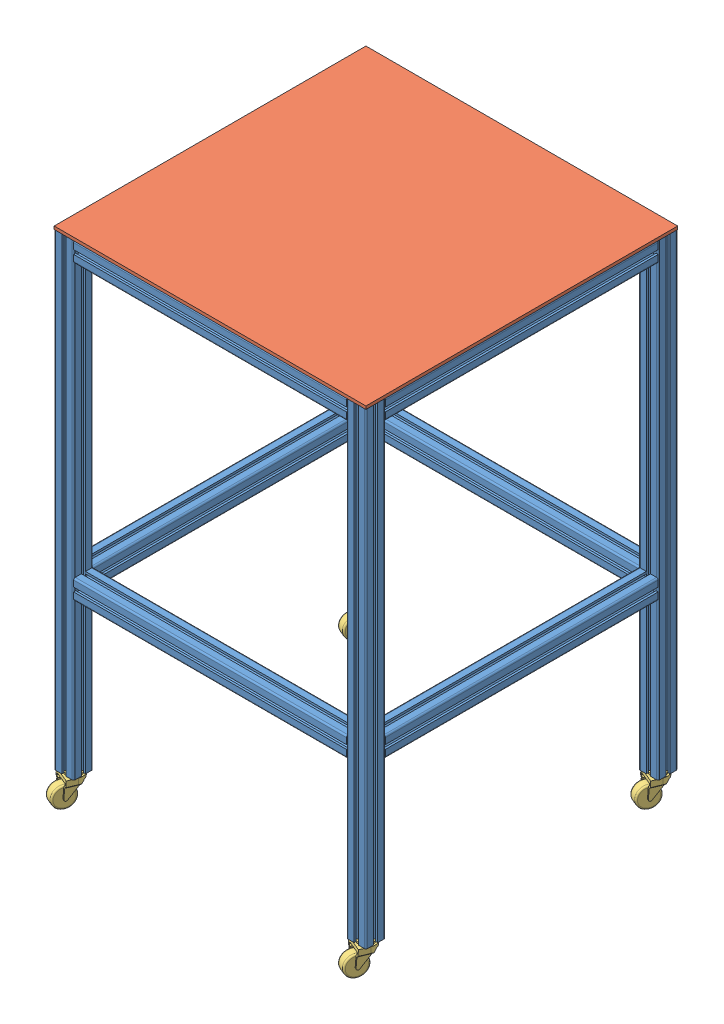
SolidWorks assembly 15-15 Table (with casters).sldasm, configuration Default (file format 4700). Lengths in mm.
Overall size (625.05 977.54 636.17).
21 component instances, 3 part files, 51 mates.
Components (placement in the parent):
- 650005-2: 650005.sldprt [36] at (-590.55 -920.3944 -19.05) x (1 0 0) z (0 -1 0) size (38.1 38.1 914.4)
- 650005-3: 650005.sldprt [21] at (-571.5 -25.0444 -19.05) x (0 1 0) z (-1 0 0) size (38.1 38.1 533.4)
- 650005-4: 650005.sldprt [36] at (-19.05 -5.9944 -19.05) x (-1 0 0) z (0 1 0) size (38.1 38.1 914.4)
- 650005-5: 650005.sldprt [21] at (-19.05 -25.0444 -38.1) x (0 1 0) z (0 0 1) size (38.1 38.1 533.4)
- 650005-6: 650005.sldprt [21] at (-590.55 -25.0444 -38.1) x (0 1 0) z (0 0 1) size (38.1 38.1 533.4)
- 650005-7: 650005.sldprt [36] at (-19.05 -5.9944 -590.55) x (0 0 1) z (0 1 0) size (38.1 38.1 914.4)
- 650005-8: 650005.sldprt [36] at (-590.55 -5.9944 -590.55) x (0 0 1) z (0 1 0) size (38.1 38.1 914.4)
- 650005-9: 650005.sldprt [21] at (-38.1 -25.0444 -590.55) x (0 0 1) z (1 0 0) size (38.1 38.1 533.4)
- 650005-10: 650005.sldprt [21] at (-19.05 -596.5444 -38.1) x (-1 0 0) z (0 0 1) size (38.1 38.1 533.4)
- 650005-11: 650005.sldprt [21] at (-571.5 -596.5444 -19.05) x (0 -1 0) z (-1 0 0) size (38.1 38.1 533.4)
- 650005-12: 650005.sldprt [21] at (-590.55 -596.5444 -571.5) x (0 1 0) z (0 0 -1) size (38.1 38.1 533.4)
- 650005-13: 650005.sldprt [21] at (-38.1 -596.5444 -590.55) x (0 0 1) z (1 0 0) size (38.1 38.1 533.4)
- 655432-1: 655432.sldprt [24x24] at (0 -5.9944 -609.6) x (0 1 0) z (1 0 0) size (5.99 609.6 609.6)
- 655231-1: 655231.sldasm [Default] at (-19.05 -920.3944 -590.55) x (-0.923728 0 -0.383049) z (0 1 0) size (34.95 55.51 95.25)
  - 655231-1: 655231.SLDPRT [Default] at origin size (34.95 55.51 95.25)
- 655231-2: 655231.sldasm [Default] at (-19.05 -920.3944 -19.05) x (-0.923728 0 -0.383049) z (0 1 0) size (34.95 55.51 95.25)
  - 655231-1: 655231.SLDPRT [Default] at origin size (34.95 55.51 95.25)
- 655231-3: 655231.sldasm [Default] at (-590.55 -920.3944 -590.55) x (-0.923728 0 -0.383049) z (0 1 0) size (34.95 55.51 95.25)
  - 655231-1: 655231.SLDPRT [Default] at origin size (34.95 55.51 95.25)
- 655231-4: 655231.sldasm [Default] at (-590.55 -920.3944 -19.05) x (-0.923728 0 -0.383049) z (0 1 0) size (34.95 55.51 95.25)
  - 655231-1: 655231.SLDPRT [Default] at origin size (34.95 55.51 95.25)
Mates (geometry in assembly coordinates):
- Coincident1: coincident anti-aligned: plane of 650005-2; plane of 650005-3 through (19.05 -25.0444 -19.05) normal (-1 0 0)
- Coincident3: coincident aligned: plane of 650005-2; plane of 650005-3
- Coincident5: coincident anti-aligned: plane of 650005-2; plane of 650005-3
- Coincident7: coincident anti-aligned: plane of 650005-3 through (552.45 -25.0444 -19.05) normal (1 0 0); plane of 650005-4
- Coincident10: coincident anti-aligned: plane of 650005-3; plane of 650005-4 through (571.5 -5.9944 -19.05) normal (0 0 1)
- Coincident11: coincident aligned: plane of 650005-3 through (552.45 -5.9944 -14.986) normal (0 1 0); plane of 650005-4 through (587.502 -5.9944 -35.052) normal (0 1 0)
- Coincident12: coincident anti-aligned: plane of 650005-4; plane of 650005-5 through (571.5 -25.0444 -38.1) normal (0 0 1)
- Coincident14: coincident aligned: plane of 650005-4 through (571.5 -5.9944 -19.05) normal (0 1 0); plane of 650005-5
- Coincident16: coincident aligned: plane of 650005-4; plane of 650005-5
- Coincident17: coincident anti-aligned: plane of 650005-2 through (0 -920.3944 -38.1) normal (0 0 -1); plane of 650005-6 through (0 -25.0444 -38.1) normal (0 0 1)
- Coincident19: coincident aligned: plane of 650005-2; plane of 650005-6
- Coincident21: coincident anti-aligned: plane of 650005-2; plane of 650005-6
- Coincident23: coincident anti-aligned: plane of 650005-5 through (571.5 -25.0444 -571.5) normal (0 0 -1); plane of 650005-7
- Coincident26: coincident anti-aligned: plane of 650005-5; plane of 650005-7
- Coincident28: coincident anti-aligned: plane of 650005-6 through (0 -25.0444 -571.5) normal (0 0 -1); plane of 650005-8
- Coincident31: coincident anti-aligned: plane of 650005-6; plane of 650005-8
- Coincident32: coincident aligned: plane of 650005-5 through (567.436 -5.9944 -571.5) normal (0 1 0); plane of 650005-7 through (555.498 -5.9944 -606.552) normal (0 1 0)
- Coincident33: coincident aligned: plane of 650005-6 through (-4.064 -5.9944 -571.5) normal (0 1 0); plane of 650005-8 through (-16.002 -5.9944 -606.552) normal (0 1 0)
- Coincident34: coincident anti-aligned: plane of 650005-7; plane of 650005-9 through (552.45 -25.0444 -590.55) normal (1 0 0)
- Coincident35: coincident aligned: plane of 650005-7; plane of 650005-9
- Coincident36: coincident aligned: plane of 650005-7 through (555.498 -5.9944 -606.552) normal (0 1 0); plane of 650005-9 through (19.05 -5.9944 -586.486) normal (0 1 0)
- Coincident37: coincident anti-aligned: plane of 650005-4; plane of 650005-10 through (571.5 -596.5444 -38.1) normal (0 0 1)
- Coincident38: coincident aligned: plane of 650005-4; plane of 650005-10
- Coincident39: coincident anti-aligned: plane of 650005-2; plane of 650005-11 through (19.05 -596.5444 -19.05) normal (-1 0 0)
- Coincident40: coincident aligned: plane of 650005-2; plane of 650005-11
- Coincident41: coincident anti-aligned: plane of 650005-8; plane of 650005-12 through (0 -596.5444 -571.5) normal (0 0 -1)
- Coincident42: coincident aligned: plane of 650005-8; plane of 650005-12
- Coincident43: coincident anti-aligned: plane of 650005-7; plane of 650005-13 through (552.45 -596.5444 -590.55) normal (1 0 0)
- Coincident44: coincident aligned: plane of 650005-7; plane of 650005-13
- Distance1: distance = 304.8 mm aligned: plane of 650005-13 through (-571.5 -615.5944 -594.614) normal (0 -1 0); plane of 650005-7 through (-35.052 -920.3944 -606.552) normal (0 -1 0)
- Distance2: distance = 304.8 mm aligned: plane of 650005-10 through (-14.986 -615.5944 -571.5) normal (0 -1 0); plane of 650005-4 through (-3.048 -920.3944 -35.052) normal (0 -1 0)
- Distance3: distance = 304.8 mm aligned: plane of 650005-11 through (-38.1 -615.5944 -23.114) normal (0 -1 0); plane of 650005-2 through (-606.552 -920.3944 -35.052) normal (0 -1 0)
- Distance4: distance = 304.8 mm aligned: plane of 650005-12 through (-594.614 -615.5944 -38.1) normal (0 -1 0); plane of 650005-8 through (-606.552 -920.3944 -606.552) normal (0 -1 0)
- Coincident51: coincident anti-aligned: plane of 650005-3 through (552.45 -5.9944 -14.986) normal (0 1 0); plane of 655432-1 through (590.55 -5.9944 0) normal (0 -1 0)
- Coincident52: coincident aligned: plane of 650005-9 through (19.05 -20.9804 -609.6) normal (0 0 -1); plane of 655432-1 through (590.55 0 -609.6) normal (0 0 -1)
- Coincident53: coincident aligned: plane of 650005-5 through (590.55 -20.9804 -571.5) normal (1 0 0); plane of 655432-1 through (590.55 0 -609.6) normal (1 0 0)
- Coincident54: coincident anti-aligned: plane of 650005-7; plane of 655231-1 through (571.5 -920.3944 -590.55) normal (0 1 0)
- Coincident55: coincident anti-aligned: plane of 650005-7; line of 655231-1 through (571.5 -882.2944 -590.55) axis (0 -1 0)
- Coincident56: coincident anti-aligned: plane of 650005-7; line of 655231-1 through (571.5 -882.2944 -590.55) axis (0 -1 0)
- Coincident57: coincident anti-aligned: plane of 650005-4; plane of 655231-2 through (571.5 -920.3944 -19.05) normal (0 1 0)
- Coincident58: coincident anti-aligned: plane of 650005-4; line of 655231-2 through (571.5 -882.2944 -19.05) axis (0 -1 0)
- Coincident59: coincident anti-aligned: plane of 650005-4 through (571.5 -5.9944 -19.05) normal (0 0 1); line of 655231-2 through (571.5 -882.2944 -19.05) axis (0 -1 0)
- Coincident60: coincident anti-aligned: plane of 650005-8; plane of 655231-3 through (0 -920.3944 -590.55) normal (0 1 0)
- Coincident61: coincident anti-aligned: plane of 650005-8; line of 655231-3 through (0 -882.2944 -590.55) axis (0 -1 0)
- Coincident62: coincident anti-aligned: plane of 650005-8; line of 655231-3 through (0 -882.2944 -590.55) axis (0 -1 0)
- Coincident63: coincident anti-aligned: plane of 650005-2 through (0 -920.3944 -19.05) normal (0 -1 0); plane of 655231-4 through (0 -920.3944 -19.05) normal (0 1 0)
- Coincident64: coincident anti-aligned: plane of 650005-2; line of 655231-4 through (0 -882.2944 -19.05) axis (0 -1 0)
- Coincident65: coincident anti-aligned: plane of 650005-2; line of 655231-4 through (0 -882.2944 -19.05) axis (0 -1 0)
- Coincident66: coincident aligned: plane of 655432-1 through (0 0 0) normal (0 1 0); plane of assembly
- Coincident67: coincident aligned: plane of 650005-3 through (-38.1 -29.1084 0) normal (0 0 1); plane of assembly
- Coincident68: coincident aligned: plane of 650005-5 through (0 -29.1084 -571.5) normal (1 0 0); plane of assembly
